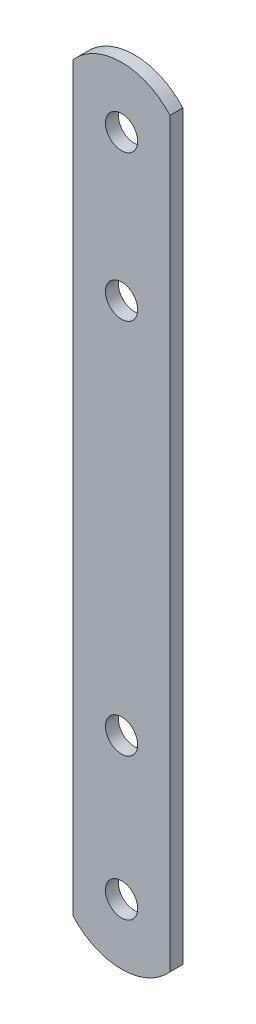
ISO-10303-21;
HEADER;
FILE_DESCRIPTION(('STEP AP214'),'2;1');
FILE_NAME('part.step','',(''),(''),'','','');
FILE_SCHEMA(('AUTOMOTIVE_DESIGN { 1 0 10303 214 1 1 1 1 }'));
ENDSEC;
DATA;
#1=APPLICATION_CONTEXT('core data for automotive mechanical design processes');
#2=APPLICATION_PROTOCOL_DEFINITION('international standard','automotive_design',2000,#1);
#3=PRODUCT_CONTEXT('',#1,'mechanical');
#4=PRODUCT('Part','Part','',(#3));
#5=PRODUCT_RELATED_PRODUCT_CATEGORY('part','',(#4));
#6=PRODUCT_DEFINITION_FORMATION('','',#4);
#7=PRODUCT_DEFINITION_CONTEXT('part definition',#1,'design');
#8=PRODUCT_DEFINITION('design','',#6,#7);
#9=PRODUCT_DEFINITION_SHAPE('','',#8);
#10=(LENGTH_UNIT() NAMED_UNIT(*) SI_UNIT(.MILLI.,.METRE.));
#11=(NAMED_UNIT(*) PLANE_ANGLE_UNIT() SI_UNIT($,.RADIAN.));
#12=(NAMED_UNIT(*) SI_UNIT($,.STERADIAN.) SOLID_ANGLE_UNIT());
#13=UNCERTAINTY_MEASURE_WITH_UNIT(LENGTH_MEASURE(1.E-05),#10,'distance_accuracy_value','');
#14=(GEOMETRIC_REPRESENTATION_CONTEXT(3) GLOBAL_UNCERTAINTY_ASSIGNED_CONTEXT((#13)) GLOBAL_UNIT_ASSIGNED_CONTEXT((#10,
#11,#12)) REPRESENTATION_CONTEXT('',''));
#15=CARTESIAN_POINT('',(0.,0.,0.));
#16=DIRECTION('',(0.,0.,1.));
#17=DIRECTION('',(1.,0.,0.));
#18=AXIS2_PLACEMENT_3D('',#15,#16,#17);
#19=CARTESIAN_POINT('',(0.,-50.8856217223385,-2.));
#20=DIRECTION('',(0.,0.,1.));
#21=DIRECTION('',(1.,0.,0.));
#22=AXIS2_PLACEMENT_3D('',#19,#20,#21);
#23=CYLINDRICAL_SURFACE('',#22,10.);
#24=CARTESIAN_POINT('',(0.,-50.8856217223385,0.));
#25=DIRECTION('',(0.,0.,1.));
#26=DIRECTION('',(1.,0.,0.));
#27=AXIS2_PLACEMENT_3D('',#24,#25,#26);
#28=CIRCLE('',#27,10.);
#29=CARTESIAN_POINT('',(7.50000000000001,-57.5,0.));
#30=VERTEX_POINT('',#29);
#31=CARTESIAN_POINT('',(-7.49999999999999,-57.5,0.));
#32=VERTEX_POINT('',#31);
#33=EDGE_CURVE('E82',#30,#32,#28,.F.);
#34=ORIENTED_EDGE('',*,*,#33,.T.);
#35=DIRECTION('',(0.,0.,1.));
#36=VECTOR('',#35,1.);
#37=CARTESIAN_POINT('',(-7.49999999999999,-57.5,-2.));
#38=LINE('',#37,#36);
#39=CARTESIAN_POINT('',(-7.49999999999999,-57.5,-2.));
#40=VERTEX_POINT('',#39);
#41=EDGE_CURVE('E11',#40,#32,#38,.T.);
#42=ORIENTED_EDGE('',*,*,#41,.F.);
#43=CARTESIAN_POINT('',(0.,-50.8856217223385,-2.));
#44=DIRECTION('',(0.,0.,1.));
#45=DIRECTION('',(1.,0.,0.));
#46=AXIS2_PLACEMENT_3D('',#43,#44,#45);
#47=CIRCLE('',#46,10.);
#48=CARTESIAN_POINT('',(7.50000000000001,-57.5,-2.));
#49=VERTEX_POINT('',#48);
#50=EDGE_CURVE('E46',#49,#40,#47,.F.);
#51=ORIENTED_EDGE('',*,*,#50,.F.);
#52=DIRECTION('',(0.,0.,1.));
#53=VECTOR('',#52,1.);
#54=CARTESIAN_POINT('',(7.50000000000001,-57.5,-2.));
#55=LINE('',#54,#53);
#56=EDGE_CURVE('E33',#49,#30,#55,.T.);
#57=ORIENTED_EDGE('',*,*,#56,.T.);
#58=EDGE_LOOP('',(#34,#42,#51,#57));
#59=FACE_BOUND('',#58,.T.);
#60=ADVANCED_FACE('F30',(#59),#23,.T.);
#61=CARTESIAN_POINT('',(-7.49999999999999,-95.5731121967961,-2.));
#62=DIRECTION('',(-1.,0.,0.));
#63=DIRECTION('',(0.,-1.,0.));
#64=AXIS2_PLACEMENT_3D('',#61,#62,#63);
#65=PLANE('',#64);
#66=DIRECTION('',(0.,-1.,0.));
#67=VECTOR('',#66,1.);
#68=CARTESIAN_POINT('',(-7.49999999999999,-95.5731121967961,0.));
#69=LINE('',#68,#67);
#70=CARTESIAN_POINT('',(-7.50000000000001,57.5,0.));
#71=VERTEX_POINT('',#70);
#72=EDGE_CURVE('E90',#71,#32,#69,.T.);
#73=ORIENTED_EDGE('',*,*,#72,.F.);
#74=DIRECTION('',(0.,0.,1.));
#75=VECTOR('',#74,1.);
#76=CARTESIAN_POINT('',(-7.50000000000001,57.5,-2.));
#77=LINE('',#76,#75);
#78=CARTESIAN_POINT('',(-7.50000000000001,57.5,-2.));
#79=VERTEX_POINT('',#78);
#80=EDGE_CURVE('E38',#79,#71,#77,.T.);
#81=ORIENTED_EDGE('',*,*,#80,.F.);
#82=DIRECTION('',(0.,-1.,0.));
#83=VECTOR('',#82,1.);
#84=CARTESIAN_POINT('',(-7.49999999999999,-95.5731121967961,-2.));
#85=LINE('',#84,#83);
#86=EDGE_CURVE('E112',#79,#40,#85,.T.);
#87=ORIENTED_EDGE('',*,*,#86,.T.);
#88=ORIENTED_EDGE('',*,*,#41,.T.);
#89=EDGE_LOOP('',(#73,#81,#87,#88));
#90=FACE_BOUND('',#89,.T.);
#91=ADVANCED_FACE('F128',(#90),#65,.T.);
#92=CARTESIAN_POINT('',(0.,50.8856217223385,-2.));
#93=DIRECTION('',(0.,0.,1.));
#94=DIRECTION('',(1.,0.,0.));
#95=AXIS2_PLACEMENT_3D('',#92,#93,#94);
#96=CYLINDRICAL_SURFACE('',#95,10.);
#97=CARTESIAN_POINT('',(0.,50.8856217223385,0.));
#98=DIRECTION('',(0.,0.,1.));
#99=DIRECTION('',(1.,0.,0.));
#100=AXIS2_PLACEMENT_3D('',#97,#98,#99);
#101=CIRCLE('',#100,10.);
#102=CARTESIAN_POINT('',(7.49999999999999,57.5,0.));
#103=VERTEX_POINT('',#102);
#104=EDGE_CURVE('E81',#103,#71,#101,.T.);
#105=ORIENTED_EDGE('',*,*,#104,.F.);
#106=DIRECTION('',(0.,0.,1.));
#107=VECTOR('',#106,1.);
#108=CARTESIAN_POINT('',(7.49999999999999,57.5,-2.));
#109=LINE('',#108,#107);
#110=CARTESIAN_POINT('',(7.49999999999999,57.5,-2.));
#111=VERTEX_POINT('',#110);
#112=EDGE_CURVE('E76',#111,#103,#109,.T.);
#113=ORIENTED_EDGE('',*,*,#112,.F.);
#114=CARTESIAN_POINT('',(0.,50.8856217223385,-2.));
#115=DIRECTION('',(0.,0.,1.));
#116=DIRECTION('',(1.,0.,0.));
#117=AXIS2_PLACEMENT_3D('',#114,#115,#116);
#118=CIRCLE('',#117,10.);
#119=EDGE_CURVE('E110',#111,#79,#118,.T.);
#120=ORIENTED_EDGE('',*,*,#119,.T.);
#121=ORIENTED_EDGE('',*,*,#80,.T.);
#122=EDGE_LOOP('',(#105,#113,#120,#121));
#123=FACE_BOUND('',#122,.T.);
#124=ADVANCED_FACE('F126',(#123),#96,.T.);
#125=CARTESIAN_POINT('',(0.,28.8856217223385,-2.));
#126=DIRECTION('',(0.,0.,1.));
#127=DIRECTION('',(1.,0.,0.));
#128=AXIS2_PLACEMENT_3D('',#125,#126,#127);
#129=CYLINDRICAL_SURFACE('',#128,2.5);
#130=CARTESIAN_POINT('',(0.,28.8856217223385,-2.));
#131=DIRECTION('',(0.,0.,1.));
#132=DIRECTION('',(1.,0.,0.));
#133=AXIS2_PLACEMENT_3D('',#130,#131,#132);
#134=CIRCLE('',#133,2.5);
#135=CARTESIAN_POINT('',(2.49999999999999,28.8856217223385,-2.));
#136=VERTEX_POINT('',#135);
#137=EDGE_CURVE('E120',#136,#136,#134,.T.);
#138=ORIENTED_EDGE('',*,*,#137,.F.);
#139=EDGE_LOOP('',(#138));
#140=FACE_BOUND('',#139,.T.);
#141=CARTESIAN_POINT('',(0.,28.8856217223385,0.));
#142=DIRECTION('',(0.,0.,1.));
#143=DIRECTION('',(1.,0.,0.));
#144=AXIS2_PLACEMENT_3D('',#141,#142,#143);
#145=CIRCLE('',#144,2.5);
#146=CARTESIAN_POINT('',(2.49999999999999,28.8856217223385,0.));
#147=VERTEX_POINT('',#146);
#148=EDGE_CURVE('E101',#147,#147,#145,.T.);
#149=ORIENTED_EDGE('',*,*,#148,.T.);
#150=EDGE_LOOP('',(#149));
#151=FACE_BOUND('',#150,.T.);
#152=ADVANCED_FACE('F159',(#140,#151),#129,.F.);
#153=CARTESIAN_POINT('',(0.,-29.5,-2.));
#154=DIRECTION('',(0.,0.,1.));
#155=DIRECTION('',(1.,0.,0.));
#156=AXIS2_PLACEMENT_3D('',#153,#154,#155);
#157=CYLINDRICAL_SURFACE('',#156,2.5);
#158=CARTESIAN_POINT('',(0.,-29.5,-2.));
#159=DIRECTION('',(0.,0.,1.));
#160=DIRECTION('',(1.,0.,0.));
#161=AXIS2_PLACEMENT_3D('',#158,#159,#160);
#162=CIRCLE('',#161,2.5);
#163=CARTESIAN_POINT('',(2.5,-29.5,-2.));
#164=VERTEX_POINT('',#163);
#165=EDGE_CURVE('E117',#164,#164,#162,.T.);
#166=ORIENTED_EDGE('',*,*,#165,.F.);
#167=EDGE_LOOP('',(#166));
#168=FACE_BOUND('',#167,.T.);
#169=CARTESIAN_POINT('',(0.,-29.5,0.));
#170=DIRECTION('',(0.,0.,1.));
#171=DIRECTION('',(1.,0.,0.));
#172=AXIS2_PLACEMENT_3D('',#169,#170,#171);
#173=CIRCLE('',#172,2.5);
#174=CARTESIAN_POINT('',(2.5,-29.5,0.));
#175=VERTEX_POINT('',#174);
#176=EDGE_CURVE('E98',#175,#175,#173,.T.);
#177=ORIENTED_EDGE('',*,*,#176,.T.);
#178=EDGE_LOOP('',(#177));
#179=FACE_BOUND('',#178,.T.);
#180=ADVANCED_FACE('F168',(#168,#179),#157,.F.);
#181=CARTESIAN_POINT('',(0.,-51.5,-2.));
#182=DIRECTION('',(0.,0.,1.));
#183=DIRECTION('',(1.,0.,0.));
#184=AXIS2_PLACEMENT_3D('',#181,#182,#183);
#185=CYLINDRICAL_SURFACE('',#184,2.5);
#186=CARTESIAN_POINT('',(0.,-51.5,-2.));
#187=DIRECTION('',(0.,0.,1.));
#188=DIRECTION('',(1.,0.,0.));
#189=AXIS2_PLACEMENT_3D('',#186,#187,#188);
#190=CIRCLE('',#189,2.5);
#191=CARTESIAN_POINT('',(2.50000000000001,-51.5,-2.));
#192=VERTEX_POINT('',#191);
#193=EDGE_CURVE('E114',#192,#192,#190,.T.);
#194=ORIENTED_EDGE('',*,*,#193,.F.);
#195=EDGE_LOOP('',(#194));
#196=FACE_BOUND('',#195,.T.);
#197=CARTESIAN_POINT('',(0.,-51.5,0.));
#198=DIRECTION('',(0.,0.,1.));
#199=DIRECTION('',(1.,0.,0.));
#200=AXIS2_PLACEMENT_3D('',#197,#198,#199);
#201=CIRCLE('',#200,2.5);
#202=CARTESIAN_POINT('',(2.50000000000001,-51.5,0.));
#203=VERTEX_POINT('',#202);
#204=EDGE_CURVE('E95',#203,#203,#201,.T.);
#205=ORIENTED_EDGE('',*,*,#204,.T.);
#206=EDGE_LOOP('',(#205));
#207=FACE_BOUND('',#206,.T.);
#208=ADVANCED_FACE('F162',(#196,#207),#185,.F.);
#209=CARTESIAN_POINT('',(7.50000000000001,-95.5731121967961,-2.));
#210=DIRECTION('',(-1.,0.,0.));
#211=DIRECTION('',(0.,-1.,0.));
#212=AXIS2_PLACEMENT_3D('',#209,#210,#211);
#213=PLANE('',#212);
#214=DIRECTION('',(0.,-1.,0.));
#215=VECTOR('',#214,1.);
#216=CARTESIAN_POINT('',(7.50000000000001,-95.5731121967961,0.));
#217=LINE('',#216,#215);
#218=EDGE_CURVE('E72',#103,#30,#217,.T.);
#219=ORIENTED_EDGE('',*,*,#218,.T.);
#220=ORIENTED_EDGE('',*,*,#56,.F.);
#221=DIRECTION('',(0.,-1.,0.));
#222=VECTOR('',#221,1.);
#223=CARTESIAN_POINT('',(7.50000000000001,-95.5731121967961,-2.));
#224=LINE('',#223,#222);
#225=EDGE_CURVE('E108',#111,#49,#224,.T.);
#226=ORIENTED_EDGE('',*,*,#225,.F.);
#227=ORIENTED_EDGE('',*,*,#112,.T.);
#228=EDGE_LOOP('',(#219,#220,#226,#227));
#229=FACE_BOUND('',#228,.T.);
#230=ADVANCED_FACE('F74',(#229),#213,.F.);
#231=CARTESIAN_POINT('',(0.,51.5,-2.));
#232=DIRECTION('',(0.,0.,1.));
#233=DIRECTION('',(1.,0.,0.));
#234=AXIS2_PLACEMENT_3D('',#231,#232,#233);
#235=CYLINDRICAL_SURFACE('',#234,2.5);
#236=CARTESIAN_POINT('',(0.,51.5,-2.));
#237=DIRECTION('',(0.,0.,1.));
#238=DIRECTION('',(1.,0.,0.));
#239=AXIS2_PLACEMENT_3D('',#236,#237,#238);
#240=CIRCLE('',#239,2.5);
#241=CARTESIAN_POINT('',(2.5,51.5,-2.));
#242=VERTEX_POINT('',#241);
#243=EDGE_CURVE('E87',#242,#242,#240,.T.);
#244=ORIENTED_EDGE('',*,*,#243,.F.);
#245=EDGE_LOOP('',(#244));
#246=FACE_BOUND('',#245,.T.);
#247=CARTESIAN_POINT('',(0.,51.5,0.));
#248=DIRECTION('',(0.,0.,1.));
#249=DIRECTION('',(1.,0.,0.));
#250=AXIS2_PLACEMENT_3D('',#247,#248,#249);
#251=CIRCLE('',#250,2.5);
#252=CARTESIAN_POINT('',(2.5,51.5,0.));
#253=VERTEX_POINT('',#252);
#254=EDGE_CURVE('E104',#253,#253,#251,.T.);
#255=ORIENTED_EDGE('',*,*,#254,.T.);
#256=EDGE_LOOP('',(#255));
#257=FACE_BOUND('',#256,.T.);
#258=ADVANCED_FACE('F132',(#246,#257),#235,.F.);
#259=CARTESIAN_POINT('',(0.,-95.5731121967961,-2.));
#260=DIRECTION('',(0.,0.,1.));
#261=DIRECTION('',(1.,0.,0.));
#262=AXIS2_PLACEMENT_3D('',#259,#260,#261);
#263=PLANE('',#262);
#264=ORIENTED_EDGE('',*,*,#50,.T.);
#265=ORIENTED_EDGE('',*,*,#86,.F.);
#266=ORIENTED_EDGE('',*,*,#119,.F.);
#267=ORIENTED_EDGE('',*,*,#225,.T.);
#268=EDGE_LOOP('',(#264,#265,#266,#267));
#269=FACE_BOUND('',#268,.T.);
#270=ORIENTED_EDGE('',*,*,#193,.T.);
#271=EDGE_LOOP('',(#270));
#272=FACE_BOUND('',#271,.T.);
#273=ORIENTED_EDGE('',*,*,#165,.T.);
#274=EDGE_LOOP('',(#273));
#275=FACE_BOUND('',#274,.T.);
#276=ORIENTED_EDGE('',*,*,#137,.T.);
#277=EDGE_LOOP('',(#276));
#278=FACE_BOUND('',#277,.T.);
#279=ORIENTED_EDGE('',*,*,#243,.T.);
#280=EDGE_LOOP('',(#279));
#281=FACE_BOUND('',#280,.T.);
#282=ADVANCED_FACE('F129',(#269,#272,#275,#278,#281),#263,.F.);
#283=CARTESIAN_POINT('',(0.,-95.5731121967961,0.));
#284=DIRECTION('',(0.,0.,1.));
#285=DIRECTION('',(1.,0.,0.));
#286=AXIS2_PLACEMENT_3D('',#283,#284,#285);
#287=PLANE('',#286);
#288=ORIENTED_EDGE('',*,*,#33,.F.);
#289=ORIENTED_EDGE('',*,*,#218,.F.);
#290=ORIENTED_EDGE('',*,*,#104,.T.);
#291=ORIENTED_EDGE('',*,*,#72,.T.);
#292=EDGE_LOOP('',(#288,#289,#290,#291));
#293=FACE_BOUND('',#292,.T.);
#294=ORIENTED_EDGE('',*,*,#204,.F.);
#295=EDGE_LOOP('',(#294));
#296=FACE_BOUND('',#295,.T.);
#297=ORIENTED_EDGE('',*,*,#176,.F.);
#298=EDGE_LOOP('',(#297));
#299=FACE_BOUND('',#298,.T.);
#300=ORIENTED_EDGE('',*,*,#148,.F.);
#301=EDGE_LOOP('',(#300));
#302=FACE_BOUND('',#301,.T.);
#303=ORIENTED_EDGE('',*,*,#254,.F.);
#304=EDGE_LOOP('',(#303));
#305=FACE_BOUND('',#304,.T.);
#306=ADVANCED_FACE('F88',(#293,#296,#299,#302,#305),#287,.T.);
#307=CLOSED_SHELL('',(#60,#91,#124,#152,#180,#208,#230,#258,#282,#306));
#308=MANIFOLD_SOLID_BREP('B2',#307);
#309=ADVANCED_BREP_SHAPE_REPRESENTATION('',(#18,#308),#14);
#310=SHAPE_DEFINITION_REPRESENTATION(#9,#309);
ENDSEC;
END-ISO-10303-21;
